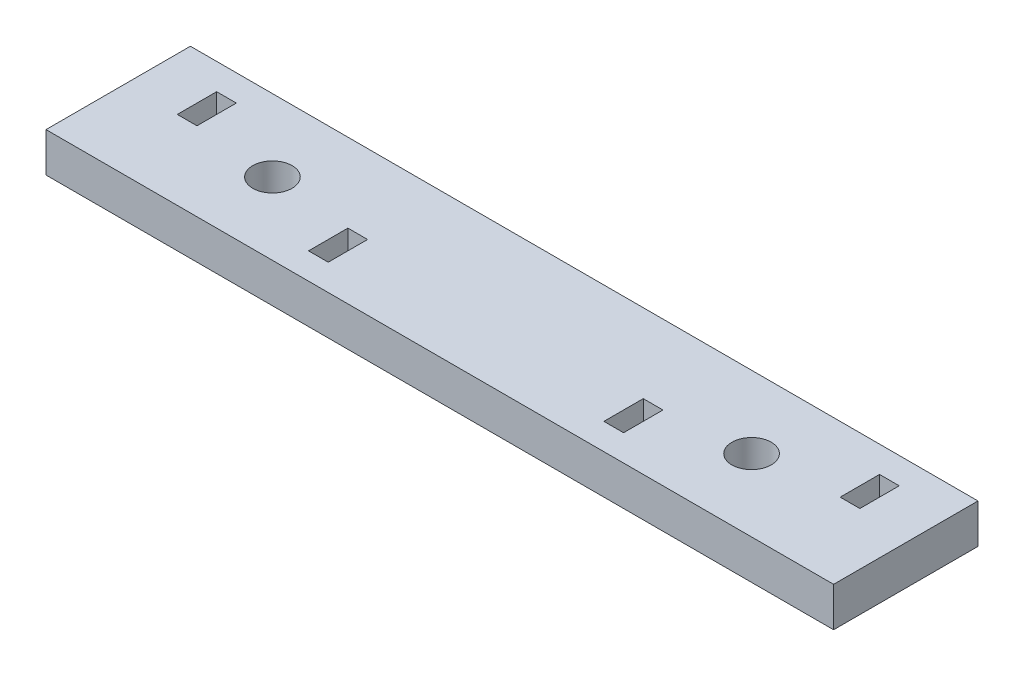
ISO-10303-21;
HEADER;
FILE_DESCRIPTION(('STEP AP214'),'2;1');
FILE_NAME('part.step','',(''),(''),'','','');
FILE_SCHEMA(('AUTOMOTIVE_DESIGN { 1 0 10303 214 1 1 1 1 }'));
ENDSEC;
DATA;
#1=APPLICATION_CONTEXT('core data for automotive mechanical design processes');
#2=APPLICATION_PROTOCOL_DEFINITION('international standard','automotive_design',2000,#1);
#3=PRODUCT_CONTEXT('',#1,'mechanical');
#4=PRODUCT('Part','Part','',(#3));
#5=PRODUCT_RELATED_PRODUCT_CATEGORY('part','',(#4));
#6=PRODUCT_DEFINITION_FORMATION('','',#4);
#7=PRODUCT_DEFINITION_CONTEXT('part definition',#1,'design');
#8=PRODUCT_DEFINITION('design','',#6,#7);
#9=PRODUCT_DEFINITION_SHAPE('','',#8);
#10=(LENGTH_UNIT() NAMED_UNIT(*) SI_UNIT(.MILLI.,.METRE.));
#11=(NAMED_UNIT(*) PLANE_ANGLE_UNIT() SI_UNIT($,.RADIAN.));
#12=(NAMED_UNIT(*) SI_UNIT($,.STERADIAN.) SOLID_ANGLE_UNIT());
#13=UNCERTAINTY_MEASURE_WITH_UNIT(LENGTH_MEASURE(1.E-05),#10,'distance_accuracy_value','');
#14=(GEOMETRIC_REPRESENTATION_CONTEXT(3) GLOBAL_UNCERTAINTY_ASSIGNED_CONTEXT((#13)) GLOBAL_UNIT_ASSIGNED_CONTEXT((#10,
#11,#12)) REPRESENTATION_CONTEXT('',''));
#15=CARTESIAN_POINT('',(0.,0.,0.));
#16=DIRECTION('',(0.,0.,1.));
#17=DIRECTION('',(1.,0.,0.));
#18=AXIS2_PLACEMENT_3D('',#15,#16,#17);
#19=CARTESIAN_POINT('',(114.3,19.05,-34.9250000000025));
#20=DIRECTION('',(-1.,0.,0.));
#21=DIRECTION('',(0.,0.,1.));
#22=AXIS2_PLACEMENT_3D('',#19,#20,#21);
#23=PLANE('',#22);
#24=DIRECTION('',(0.,0.,-1.));
#25=VECTOR('',#24,1.);
#26=CARTESIAN_POINT('',(114.3,0.,-34.9250000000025));
#27=LINE('',#26,#25);
#28=CARTESIAN_POINT('',(114.3,0.,-12.6999999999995));
#29=VERTEX_POINT('',#28);
#30=CARTESIAN_POINT('',(114.3,0.,-31.7499999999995));
#31=VERTEX_POINT('',#30);
#32=EDGE_CURVE('E257',#29,#31,#27,.T.);
#33=ORIENTED_EDGE('',*,*,#32,.T.);
#34=DIRECTION('',(0.,-1.,0.));
#35=VECTOR('',#34,1.);
#36=CARTESIAN_POINT('',(114.3,19.05,-31.7499999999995));
#37=LINE('',#36,#35);
#38=CARTESIAN_POINT('',(114.3,19.05,-31.7499999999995));
#39=VERTEX_POINT('',#38);
#40=EDGE_CURVE('E11',#39,#31,#37,.T.);
#41=ORIENTED_EDGE('',*,*,#40,.F.);
#42=DIRECTION('',(0.,0.,-1.));
#43=VECTOR('',#42,1.);
#44=CARTESIAN_POINT('',(114.3,19.05,-34.9250000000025));
#45=LINE('',#44,#43);
#46=CARTESIAN_POINT('',(114.3,19.05,-12.6999999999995));
#47=VERTEX_POINT('',#46);
#48=EDGE_CURVE('E186',#47,#39,#45,.T.);
#49=ORIENTED_EDGE('',*,*,#48,.F.);
#50=DIRECTION('',(0.,-1.,0.));
#51=VECTOR('',#50,1.);
#52=CARTESIAN_POINT('',(114.3,19.05,-12.6999999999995));
#53=LINE('',#52,#51);
#54=EDGE_CURVE('E54',#47,#29,#53,.T.);
#55=ORIENTED_EDGE('',*,*,#54,.T.);
#56=EDGE_LOOP('',(#33,#41,#49,#55));
#57=FACE_BOUND('',#56,.T.);
#58=ADVANCED_FACE('F35',(#57),#23,.F.);
#59=CARTESIAN_POINT('',(-110.929014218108,19.05,-31.749999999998));
#60=DIRECTION('',(0.,0.,-1.));
#61=DIRECTION('',(-1.,0.,0.));
#62=AXIS2_PLACEMENT_3D('',#59,#60,#61);
#63=PLANE('',#62);
#64=DIRECTION('',(1.,0.,0.));
#65=VECTOR('',#64,1.);
#66=CARTESIAN_POINT('',(-110.929014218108,0.,-31.749999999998));
#67=LINE('',#66,#65);
#68=CARTESIAN_POINT('',(123.825,0.,-31.7499999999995));
#69=VERTEX_POINT('',#68);
#70=EDGE_CURVE('E192',#31,#69,#67,.T.);
#71=ORIENTED_EDGE('',*,*,#70,.T.);
#72=DIRECTION('',(0.,-1.,0.));
#73=VECTOR('',#72,1.);
#74=CARTESIAN_POINT('',(123.825,19.05,-31.7499999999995));
#75=LINE('',#74,#73);
#76=CARTESIAN_POINT('',(123.825,19.05,-31.7499999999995));
#77=VERTEX_POINT('',#76);
#78=EDGE_CURVE('E45',#77,#69,#75,.T.);
#79=ORIENTED_EDGE('',*,*,#78,.F.);
#80=DIRECTION('',(1.,0.,0.));
#81=VECTOR('',#80,1.);
#82=CARTESIAN_POINT('',(-110.929014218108,19.05,-31.749999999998));
#83=LINE('',#82,#81);
#84=EDGE_CURVE('E180',#39,#77,#83,.T.);
#85=ORIENTED_EDGE('',*,*,#84,.F.);
#86=ORIENTED_EDGE('',*,*,#40,.T.);
#87=EDGE_LOOP('',(#71,#79,#85,#86));
#88=FACE_BOUND('',#87,.T.);
#89=ADVANCED_FACE('F191',(#88),#63,.F.);
#90=CARTESIAN_POINT('',(123.825,19.05,-34.9250000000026));
#91=DIRECTION('',(-1.,0.,0.));
#92=DIRECTION('',(0.,0.,1.));
#93=AXIS2_PLACEMENT_3D('',#90,#91,#92);
#94=PLANE('',#93);
#95=DIRECTION('',(0.,0.,-1.));
#96=VECTOR('',#95,1.);
#97=CARTESIAN_POINT('',(123.825,0.,-34.9250000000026));
#98=LINE('',#97,#96);
#99=CARTESIAN_POINT('',(123.825,0.,-12.6999999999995));
#100=VERTEX_POINT('',#99);
#101=EDGE_CURVE('E260',#100,#69,#98,.T.);
#102=ORIENTED_EDGE('',*,*,#101,.F.);
#103=DIRECTION('',(0.,-1.,0.));
#104=VECTOR('',#103,1.);
#105=CARTESIAN_POINT('',(123.825,19.05,-12.6999999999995));
#106=LINE('',#105,#104);
#107=CARTESIAN_POINT('',(123.825,19.05,-12.6999999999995));
#108=VERTEX_POINT('',#107);
#109=EDGE_CURVE('E116',#108,#100,#106,.T.);
#110=ORIENTED_EDGE('',*,*,#109,.F.);
#111=DIRECTION('',(0.,0.,-1.));
#112=VECTOR('',#111,1.);
#113=CARTESIAN_POINT('',(123.825,19.05,-34.9250000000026));
#114=LINE('',#113,#112);
#115=EDGE_CURVE('E185',#108,#77,#114,.T.);
#116=ORIENTED_EDGE('',*,*,#115,.T.);
#117=ORIENTED_EDGE('',*,*,#78,.T.);
#118=EDGE_LOOP('',(#102,#110,#116,#117));
#119=FACE_BOUND('',#118,.T.);
#120=ADVANCED_FACE('F196',(#119),#94,.T.);
#121=CARTESIAN_POINT('',(-110.929014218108,19.05,-38.0999999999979));
#122=DIRECTION('',(0.,0.,-1.));
#123=DIRECTION('',(-1.,0.,0.));
#124=AXIS2_PLACEMENT_3D('',#121,#122,#123);
#125=PLANE('',#124);
#126=DIRECTION('',(1.,0.,0.));
#127=VECTOR('',#126,1.);
#128=CARTESIAN_POINT('',(-110.929014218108,0.,-38.0999999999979));
#129=LINE('',#128,#127);
#130=CARTESIAN_POINT('',(25.4,0.,-38.0999999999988));
#131=VERTEX_POINT('',#130);
#132=CARTESIAN_POINT('',(34.925,0.,-38.0999999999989));
#133=VERTEX_POINT('',#132);
#134=EDGE_CURVE('E245',#131,#133,#129,.T.);
#135=ORIENTED_EDGE('',*,*,#134,.F.);
#136=DIRECTION('',(0.,-1.,0.));
#137=VECTOR('',#136,1.);
#138=CARTESIAN_POINT('',(25.4,19.05,-38.0999999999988));
#139=LINE('',#138,#137);
#140=CARTESIAN_POINT('',(25.4,19.05,-38.0999999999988));
#141=VERTEX_POINT('',#140);
#142=EDGE_CURVE('E267',#141,#131,#139,.T.);
#143=ORIENTED_EDGE('',*,*,#142,.F.);
#144=DIRECTION('',(1.,0.,0.));
#145=VECTOR('',#144,1.);
#146=CARTESIAN_POINT('',(-110.929014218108,19.05,-38.0999999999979));
#147=LINE('',#146,#145);
#148=CARTESIAN_POINT('',(34.925,19.05,-38.0999999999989));
#149=VERTEX_POINT('',#148);
#150=EDGE_CURVE('E577',#141,#149,#147,.T.);
#151=ORIENTED_EDGE('',*,*,#150,.T.);
#152=DIRECTION('',(0.,-1.,0.));
#153=VECTOR('',#152,1.);
#154=CARTESIAN_POINT('',(34.925,19.05,-38.0999999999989));
#155=LINE('',#154,#153);
#156=EDGE_CURVE('E269',#149,#133,#155,.T.);
#157=ORIENTED_EDGE('',*,*,#156,.T.);
#158=EDGE_LOOP('',(#135,#143,#151,#157));
#159=FACE_BOUND('',#158,.T.);
#160=ADVANCED_FACE('F348',(#159),#125,.T.);
#161=CARTESIAN_POINT('',(25.4,19.05,-34.9250000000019));
#162=DIRECTION('',(1.,0.,0.));
#163=DIRECTION('',(0.,0.,-1.));
#164=AXIS2_PLACEMENT_3D('',#161,#162,#163);
#165=PLANE('',#164);
#166=DIRECTION('',(0.,0.,1.));
#167=VECTOR('',#166,1.);
#168=CARTESIAN_POINT('',(25.4,0.,-34.9250000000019));
#169=LINE('',#168,#167);
#170=CARTESIAN_POINT('',(25.3999999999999,0.,-57.1499999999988));
#171=VERTEX_POINT('',#170);
#172=EDGE_CURVE('E248',#171,#131,#169,.T.);
#173=ORIENTED_EDGE('',*,*,#172,.F.);
#174=DIRECTION('',(0.,-1.,0.));
#175=VECTOR('',#174,1.);
#176=CARTESIAN_POINT('',(25.3999999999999,19.05,-57.1499999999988));
#177=LINE('',#176,#175);
#178=CARTESIAN_POINT('',(25.3999999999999,19.05,-57.1499999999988));
#179=VERTEX_POINT('',#178);
#180=EDGE_CURVE('E275',#179,#171,#177,.T.);
#181=ORIENTED_EDGE('',*,*,#180,.F.);
#182=DIRECTION('',(0.,0.,1.));
#183=VECTOR('',#182,1.);
#184=CARTESIAN_POINT('',(25.4,19.05,-34.9250000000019));
#185=LINE('',#184,#183);
#186=EDGE_CURVE('E580',#179,#141,#185,.T.);
#187=ORIENTED_EDGE('',*,*,#186,.T.);
#188=ORIENTED_EDGE('',*,*,#142,.T.);
#189=EDGE_LOOP('',(#173,#181,#187,#188));
#190=FACE_BOUND('',#189,.T.);
#191=ADVANCED_FACE('F344',(#190),#165,.T.);
#192=CARTESIAN_POINT('',(-110.929014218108,19.05,-57.149999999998));
#193=DIRECTION('',(0.,0.,-1.));
#194=DIRECTION('',(-1.,0.,0.));
#195=AXIS2_PLACEMENT_3D('',#192,#193,#194);
#196=PLANE('',#195);
#197=DIRECTION('',(1.,0.,0.));
#198=VECTOR('',#197,1.);
#199=CARTESIAN_POINT('',(-110.929014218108,0.,-57.149999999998));
#200=LINE('',#199,#198);
#201=CARTESIAN_POINT('',(34.9249999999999,0.,-57.1499999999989));
#202=VERTEX_POINT('',#201);
#203=EDGE_CURVE('E251',#171,#202,#200,.T.);
#204=ORIENTED_EDGE('',*,*,#203,.T.);
#205=DIRECTION('',(0.,-1.,0.));
#206=VECTOR('',#205,1.);
#207=CARTESIAN_POINT('',(34.9249999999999,19.05,-57.1499999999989));
#208=LINE('',#207,#206);
#209=CARTESIAN_POINT('',(34.9249999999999,19.05,-57.1499999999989));
#210=VERTEX_POINT('',#209);
#211=EDGE_CURVE('E271',#210,#202,#208,.T.);
#212=ORIENTED_EDGE('',*,*,#211,.F.);
#213=DIRECTION('',(1.,0.,0.));
#214=VECTOR('',#213,1.);
#215=CARTESIAN_POINT('',(-110.929014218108,19.05,-57.149999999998));
#216=LINE('',#215,#214);
#217=EDGE_CURVE('E587',#179,#210,#216,.T.);
#218=ORIENTED_EDGE('',*,*,#217,.F.);
#219=ORIENTED_EDGE('',*,*,#180,.T.);
#220=EDGE_LOOP('',(#204,#212,#218,#219));
#221=FACE_BOUND('',#220,.T.);
#222=ADVANCED_FACE('F340',(#221),#196,.F.);
#223=CARTESIAN_POINT('',(-110.929014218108,19.05,-4.5102810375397E-13));
#224=DIRECTION('',(0.,0.,1.));
#225=DIRECTION('',(1.,0.,0.));
#226=AXIS2_PLACEMENT_3D('',#223,#224,#225);
#227=PLANE('',#226);
#228=DIRECTION('',(-1.,0.,0.));
#229=VECTOR('',#228,1.);
#230=CARTESIAN_POINT('',(-110.929014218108,0.,-4.5102810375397E-13));
#231=LINE('',#230,#229);
#232=CARTESIAN_POINT('',(381.,0.,-1.33226762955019E-12));
#233=VERTEX_POINT('',#232);
#234=CARTESIAN_POINT('',(2.77555756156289E-13,0.,-6.50068807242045E-13));
#235=VERTEX_POINT('',#234);
#236=EDGE_CURVE('E230',#233,#235,#231,.T.);
#237=ORIENTED_EDGE('',*,*,#236,.F.);
#238=DIRECTION('',(0.,-1.,0.));
#239=VECTOR('',#238,1.);
#240=CARTESIAN_POINT('',(381.,19.05,-1.33226762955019E-12));
#241=LINE('',#240,#239);
#242=CARTESIAN_POINT('',(381.,19.05,-1.33226762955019E-12));
#243=VERTEX_POINT('',#242);
#244=EDGE_CURVE('E272',#243,#233,#241,.T.);
#245=ORIENTED_EDGE('',*,*,#244,.F.);
#246=DIRECTION('',(-1.,0.,0.));
#247=VECTOR('',#246,1.);
#248=CARTESIAN_POINT('',(-110.929014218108,19.05,-4.5102810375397E-13));
#249=LINE('',#248,#247);
#250=CARTESIAN_POINT('',(2.77555756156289E-13,19.05,-6.50068807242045E-13));
#251=VERTEX_POINT('',#250);
#252=EDGE_CURVE('E568',#243,#251,#249,.T.);
#253=ORIENTED_EDGE('',*,*,#252,.T.);
#254=DIRECTION('',(0.,-1.,0.));
#255=VECTOR('',#254,1.);
#256=CARTESIAN_POINT('',(2.77555756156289E-13,19.05,-6.50068807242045E-13));
#257=LINE('',#256,#255);
#258=EDGE_CURVE('E278',#251,#235,#257,.T.);
#259=ORIENTED_EDGE('',*,*,#258,.T.);
#260=EDGE_LOOP('',(#237,#245,#253,#259));
#261=FACE_BOUND('',#260,.T.);
#262=ADVANCED_FACE('F343',(#261),#227,.T.);
#263=CARTESIAN_POINT('',(381.000000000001,19.05,-34.9250000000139));
#264=DIRECTION('',(1.,0.,0.));
#265=DIRECTION('',(0.,0.,-1.));
#266=AXIS2_PLACEMENT_3D('',#263,#264,#265);
#267=PLANE('',#266);
#268=DIRECTION('',(0.,0.,1.));
#269=VECTOR('',#268,1.);
#270=CARTESIAN_POINT('',(381.000000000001,0.,-34.9250000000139));
#271=LINE('',#270,#269);
#272=CARTESIAN_POINT('',(381.,0.,-69.8500000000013));
#273=VERTEX_POINT('',#272);
#274=EDGE_CURVE('E233',#273,#233,#271,.T.);
#275=ORIENTED_EDGE('',*,*,#274,.F.);
#276=DIRECTION('',(0.,-1.,0.));
#277=VECTOR('',#276,1.);
#278=CARTESIAN_POINT('',(381.,19.05,-69.8500000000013));
#279=LINE('',#278,#277);
#280=CARTESIAN_POINT('',(381.,19.05,-69.8500000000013));
#281=VERTEX_POINT('',#280);
#282=EDGE_CURVE('E284',#281,#273,#279,.T.);
#283=ORIENTED_EDGE('',*,*,#282,.F.);
#284=DIRECTION('',(0.,0.,1.));
#285=VECTOR('',#284,1.);
#286=CARTESIAN_POINT('',(381.000000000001,19.05,-34.9250000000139));
#287=LINE('',#286,#285);
#288=EDGE_CURVE('E598',#281,#243,#287,.T.);
#289=ORIENTED_EDGE('',*,*,#288,.T.);
#290=ORIENTED_EDGE('',*,*,#244,.T.);
#291=EDGE_LOOP('',(#275,#283,#289,#290));
#292=FACE_BOUND('',#291,.T.);
#293=ADVANCED_FACE('F365',(#292),#267,.T.);
#294=CARTESIAN_POINT('',(-110.929014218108,19.05,-69.8500000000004));
#295=DIRECTION('',(0.,0.,1.));
#296=DIRECTION('',(1.,0.,0.));
#297=AXIS2_PLACEMENT_3D('',#294,#295,#296);
#298=PLANE('',#297);
#299=DIRECTION('',(-1.,0.,0.));
#300=VECTOR('',#299,1.);
#301=CARTESIAN_POINT('',(-110.929014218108,0.,-69.8500000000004));
#302=LINE('',#301,#300);
#303=CARTESIAN_POINT('',(0.,0.,-69.8500000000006));
#304=VERTEX_POINT('',#303);
#305=EDGE_CURVE('E236',#273,#304,#302,.T.);
#306=ORIENTED_EDGE('',*,*,#305,.T.);
#307=DIRECTION('',(0.,-1.,0.));
#308=VECTOR('',#307,1.);
#309=CARTESIAN_POINT('',(0.,19.05,-69.8500000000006));
#310=LINE('',#309,#308);
#311=CARTESIAN_POINT('',(0.,19.05,-69.8500000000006));
#312=VERTEX_POINT('',#311);
#313=EDGE_CURVE('E280',#312,#304,#310,.T.);
#314=ORIENTED_EDGE('',*,*,#313,.F.);
#315=DIRECTION('',(-1.,0.,0.));
#316=VECTOR('',#315,1.);
#317=CARTESIAN_POINT('',(-110.929014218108,19.05,-69.8500000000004));
#318=LINE('',#317,#316);
#319=EDGE_CURVE('E595',#281,#312,#318,.T.);
#320=ORIENTED_EDGE('',*,*,#319,.F.);
#321=ORIENTED_EDGE('',*,*,#282,.T.);
#322=EDGE_LOOP('',(#306,#314,#320,#321));
#323=FACE_BOUND('',#322,.T.);
#324=ADVANCED_FACE('F361',(#323),#298,.F.);
#325=CARTESIAN_POINT('',(266.7,19.05,-34.9250000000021));
#326=DIRECTION('',(-1.,0.,0.));
#327=DIRECTION('',(0.,0.,1.));
#328=AXIS2_PLACEMENT_3D('',#325,#326,#327);
#329=PLANE('',#328);
#330=DIRECTION('',(0.,0.,-1.));
#331=VECTOR('',#330,1.);
#332=CARTESIAN_POINT('',(266.7,0.,-34.9250000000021));
#333=LINE('',#332,#331);
#334=CARTESIAN_POINT('',(266.7,0.,-12.7000000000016));
#335=VERTEX_POINT('',#334);
#336=CARTESIAN_POINT('',(266.7,0.,-31.7500000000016));
#337=VERTEX_POINT('',#336);
#338=EDGE_CURVE('E218',#335,#337,#333,.T.);
#339=ORIENTED_EDGE('',*,*,#338,.F.);
#340=DIRECTION('',(0.,-1.,0.));
#341=VECTOR('',#340,1.);
#342=CARTESIAN_POINT('',(266.7,19.05,-12.7000000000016));
#343=LINE('',#342,#341);
#344=CARTESIAN_POINT('',(266.7,19.05,-12.7000000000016));
#345=VERTEX_POINT('',#344);
#346=EDGE_CURVE('E281',#345,#335,#343,.T.);
#347=ORIENTED_EDGE('',*,*,#346,.F.);
#348=DIRECTION('',(0.,0.,-1.));
#349=VECTOR('',#348,1.);
#350=CARTESIAN_POINT('',(266.7,19.05,-34.9250000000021));
#351=LINE('',#350,#349);
#352=CARTESIAN_POINT('',(266.7,19.05,-31.7500000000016));
#353=VERTEX_POINT('',#352);
#354=EDGE_CURVE('E563',#345,#353,#351,.T.);
#355=ORIENTED_EDGE('',*,*,#354,.T.);
#356=DIRECTION('',(0.,-1.,0.));
#357=VECTOR('',#356,1.);
#358=CARTESIAN_POINT('',(266.7,19.05,-31.7500000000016));
#359=LINE('',#358,#357);
#360=EDGE_CURVE('E287',#353,#337,#359,.T.);
#361=ORIENTED_EDGE('',*,*,#360,.T.);
#362=EDGE_LOOP('',(#339,#347,#355,#361));
#363=FACE_BOUND('',#362,.T.);
#364=ADVANCED_FACE('F364',(#363),#329,.T.);
#365=CARTESIAN_POINT('',(-110.929014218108,19.05,-12.7000000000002));
#366=DIRECTION('',(0.,0.,1.));
#367=DIRECTION('',(1.,0.,0.));
#368=AXIS2_PLACEMENT_3D('',#365,#366,#367);
#369=PLANE('',#368);
#370=DIRECTION('',(-1.,0.,0.));
#371=VECTOR('',#370,1.);
#372=CARTESIAN_POINT('',(-110.929014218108,0.,-12.7000000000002));
#373=LINE('',#372,#371);
#374=CARTESIAN_POINT('',(257.175,0.,-12.7000000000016));
#375=VERTEX_POINT('',#374);
#376=EDGE_CURVE('E221',#335,#375,#373,.T.);
#377=ORIENTED_EDGE('',*,*,#376,.T.);
#378=DIRECTION('',(0.,-1.,0.));
#379=VECTOR('',#378,1.);
#380=CARTESIAN_POINT('',(257.175,19.05,-12.7000000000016));
#381=LINE('',#380,#379);
#382=CARTESIAN_POINT('',(257.175,19.05,-12.7000000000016));
#383=VERTEX_POINT('',#382);
#384=EDGE_CURVE('E291',#383,#375,#381,.T.);
#385=ORIENTED_EDGE('',*,*,#384,.F.);
#386=DIRECTION('',(-1.,0.,0.));
#387=VECTOR('',#386,1.);
#388=CARTESIAN_POINT('',(-110.929014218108,19.05,-12.7000000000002));
#389=LINE('',#388,#387);
#390=EDGE_CURVE('E606',#345,#383,#389,.T.);
#391=ORIENTED_EDGE('',*,*,#390,.F.);
#392=ORIENTED_EDGE('',*,*,#346,.T.);
#393=EDGE_LOOP('',(#377,#385,#391,#392));
#394=FACE_BOUND('',#393,.T.);
#395=ADVANCED_FACE('F379',(#394),#369,.F.);
#396=CARTESIAN_POINT('',(257.175,19.05,-34.9250000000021));
#397=DIRECTION('',(-1.,0.,0.));
#398=DIRECTION('',(0.,0.,1.));
#399=AXIS2_PLACEMENT_3D('',#396,#397,#398);
#400=PLANE('',#399);
#401=DIRECTION('',(0.,0.,-1.));
#402=VECTOR('',#401,1.);
#403=CARTESIAN_POINT('',(257.175,0.,-34.9250000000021));
#404=LINE('',#403,#402);
#405=CARTESIAN_POINT('',(257.175,0.,-31.7500000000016));
#406=VERTEX_POINT('',#405);
#407=EDGE_CURVE('E224',#375,#406,#404,.T.);
#408=ORIENTED_EDGE('',*,*,#407,.T.);
#409=DIRECTION('',(0.,-1.,0.));
#410=VECTOR('',#409,1.);
#411=CARTESIAN_POINT('',(257.175,19.05,-31.7500000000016));
#412=LINE('',#411,#410);
#413=CARTESIAN_POINT('',(257.175,19.05,-31.7500000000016));
#414=VERTEX_POINT('',#413);
#415=EDGE_CURVE('E289',#414,#406,#412,.T.);
#416=ORIENTED_EDGE('',*,*,#415,.F.);
#417=DIRECTION('',(0.,0.,-1.));
#418=VECTOR('',#417,1.);
#419=CARTESIAN_POINT('',(257.175,19.05,-34.9250000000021));
#420=LINE('',#419,#418);
#421=EDGE_CURVE('E604',#383,#414,#420,.T.);
#422=ORIENTED_EDGE('',*,*,#421,.F.);
#423=ORIENTED_EDGE('',*,*,#384,.T.);
#424=EDGE_LOOP('',(#408,#416,#422,#423));
#425=FACE_BOUND('',#424,.T.);
#426=ADVANCED_FACE('F376',(#425),#400,.F.);
#427=CARTESIAN_POINT('',(-110.929014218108,19.05,-57.1500000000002));
#428=DIRECTION('',(0.,0.,1.));
#429=DIRECTION('',(1.,0.,0.));
#430=AXIS2_PLACEMENT_3D('',#427,#428,#429);
#431=PLANE('',#430);
#432=DIRECTION('',(-1.,0.,0.));
#433=VECTOR('',#432,1.);
#434=CARTESIAN_POINT('',(-110.929014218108,0.,-57.1500000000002));
#435=LINE('',#434,#433);
#436=CARTESIAN_POINT('',(355.6,0.,-57.1500000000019));
#437=VERTEX_POINT('',#436);
#438=CARTESIAN_POINT('',(346.075,0.,-57.1500000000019));
#439=VERTEX_POINT('',#438);
#440=EDGE_CURVE('E206',#437,#439,#435,.T.);
#441=ORIENTED_EDGE('',*,*,#440,.F.);
#442=DIRECTION('',(0.,-1.,0.));
#443=VECTOR('',#442,1.);
#444=CARTESIAN_POINT('',(355.6,19.05,-57.1500000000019));
#445=LINE('',#444,#443);
#446=CARTESIAN_POINT('',(355.6,19.05,-57.1500000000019));
#447=VERTEX_POINT('',#446);
#448=EDGE_CURVE('E39',#447,#437,#445,.T.);
#449=ORIENTED_EDGE('',*,*,#448,.F.);
#450=DIRECTION('',(-1.,0.,0.));
#451=VECTOR('',#450,1.);
#452=CARTESIAN_POINT('',(-110.929014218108,19.05,-57.1500000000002));
#453=LINE('',#452,#451);
#454=CARTESIAN_POINT('',(346.075,19.05,-57.1500000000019));
#455=VERTEX_POINT('',#454);
#456=EDGE_CURVE('E312',#447,#455,#453,.T.);
#457=ORIENTED_EDGE('',*,*,#456,.T.);
#458=DIRECTION('',(0.,-1.,0.));
#459=VECTOR('',#458,1.);
#460=CARTESIAN_POINT('',(346.075,19.05,-57.1500000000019));
#461=LINE('',#460,#459);
#462=EDGE_CURVE('E199',#455,#439,#461,.T.);
#463=ORIENTED_EDGE('',*,*,#462,.T.);
#464=EDGE_LOOP('',(#441,#449,#457,#463));
#465=FACE_BOUND('',#464,.T.);
#466=ADVANCED_FACE('F311',(#465),#431,.T.);
#467=CARTESIAN_POINT('',(355.6,19.05,-34.9250000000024));
#468=DIRECTION('',(1.,0.,0.));
#469=DIRECTION('',(0.,0.,-1.));
#470=AXIS2_PLACEMENT_3D('',#467,#468,#469);
#471=PLANE('',#470);
#472=DIRECTION('',(0.,0.,1.));
#473=VECTOR('',#472,1.);
#474=CARTESIAN_POINT('',(355.6,0.,-34.9250000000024));
#475=LINE('',#474,#473);
#476=CARTESIAN_POINT('',(355.6,0.,-38.1000000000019));
#477=VERTEX_POINT('',#476);
#478=EDGE_CURVE('E209',#437,#477,#475,.T.);
#479=ORIENTED_EDGE('',*,*,#478,.T.);
#480=DIRECTION('',(0.,-1.,0.));
#481=VECTOR('',#480,1.);
#482=CARTESIAN_POINT('',(355.6,19.05,-38.1000000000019));
#483=LINE('',#482,#481);
#484=CARTESIAN_POINT('',(355.6,19.05,-38.1000000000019));
#485=VERTEX_POINT('',#484);
#486=EDGE_CURVE('E297',#485,#477,#483,.T.);
#487=ORIENTED_EDGE('',*,*,#486,.F.);
#488=DIRECTION('',(0.,0.,1.));
#489=VECTOR('',#488,1.);
#490=CARTESIAN_POINT('',(355.6,19.05,-34.9250000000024));
#491=LINE('',#490,#489);
#492=EDGE_CURVE('E305',#447,#485,#491,.T.);
#493=ORIENTED_EDGE('',*,*,#492,.F.);
#494=ORIENTED_EDGE('',*,*,#448,.T.);
#495=EDGE_LOOP('',(#479,#487,#493,#494));
#496=FACE_BOUND('',#495,.T.);
#497=ADVANCED_FACE('F303',(#496),#471,.F.);
#498=CARTESIAN_POINT('',(-110.929014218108,19.05,-38.1000000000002));
#499=DIRECTION('',(0.,0.,1.));
#500=DIRECTION('',(1.,0.,0.));
#501=AXIS2_PLACEMENT_3D('',#498,#499,#500);
#502=PLANE('',#501);
#503=DIRECTION('',(-1.,0.,0.));
#504=VECTOR('',#503,1.);
#505=CARTESIAN_POINT('',(-110.929014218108,0.,-38.1000000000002));
#506=LINE('',#505,#504);
#507=CARTESIAN_POINT('',(346.075,0.,-38.1000000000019));
#508=VERTEX_POINT('',#507);
#509=EDGE_CURVE('E212',#477,#508,#506,.T.);
#510=ORIENTED_EDGE('',*,*,#509,.T.);
#511=DIRECTION('',(0.,-1.,0.));
#512=VECTOR('',#511,1.);
#513=CARTESIAN_POINT('',(346.075,19.05,-38.1000000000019));
#514=LINE('',#513,#512);
#515=CARTESIAN_POINT('',(346.075,19.05,-38.1000000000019));
#516=VERTEX_POINT('',#515);
#517=EDGE_CURVE('E296',#516,#508,#514,.T.);
#518=ORIENTED_EDGE('',*,*,#517,.F.);
#519=DIRECTION('',(-1.,0.,0.));
#520=VECTOR('',#519,1.);
#521=CARTESIAN_POINT('',(-110.929014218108,19.05,-38.1000000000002));
#522=LINE('',#521,#520);
#523=EDGE_CURVE('E610',#485,#516,#522,.T.);
#524=ORIENTED_EDGE('',*,*,#523,.F.);
#525=ORIENTED_EDGE('',*,*,#486,.T.);
#526=EDGE_LOOP('',(#510,#518,#524,#525));
#527=FACE_BOUND('',#526,.T.);
#528=ADVANCED_FACE('F319',(#527),#502,.F.);
#529=CARTESIAN_POINT('',(34.925,19.05,-34.9250000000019));
#530=DIRECTION('',(1.,0.,0.));
#531=DIRECTION('',(0.,0.,-1.));
#532=AXIS2_PLACEMENT_3D('',#529,#530,#531);
#533=PLANE('',#532);
#534=DIRECTION('',(0.,0.,1.));
#535=VECTOR('',#534,1.);
#536=CARTESIAN_POINT('',(34.925,0.,-34.9250000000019));
#537=LINE('',#536,#535);
#538=EDGE_CURVE('E254',#202,#133,#537,.T.);
#539=ORIENTED_EDGE('',*,*,#538,.T.);
#540=ORIENTED_EDGE('',*,*,#156,.F.);
#541=DIRECTION('',(0.,0.,1.));
#542=VECTOR('',#541,1.);
#543=CARTESIAN_POINT('',(34.925,19.05,-34.9250000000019));
#544=LINE('',#543,#542);
#545=EDGE_CURVE('E581',#210,#149,#544,.T.);
#546=ORIENTED_EDGE('',*,*,#545,.F.);
#547=ORIENTED_EDGE('',*,*,#211,.T.);
#548=EDGE_LOOP('',(#539,#540,#546,#547));
#549=FACE_BOUND('',#548,.T.);
#550=ADVANCED_FACE('F321',(#549),#533,.F.);
#551=CARTESIAN_POINT('',(74.6125,19.05,-34.9249999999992));
#552=DIRECTION('',(0.,-1.,0.));
#553=DIRECTION('',(0.,0.,-1.));
#554=AXIS2_PLACEMENT_3D('',#551,#552,#553);
#555=CYLINDRICAL_SURFACE('',#554,9.52500000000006);
#556=CARTESIAN_POINT('',(74.6125,19.05,-34.9249999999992));
#557=DIRECTION('',(0.,1.,0.));
#558=DIRECTION('',(0.,0.,1.));
#559=AXIS2_PLACEMENT_3D('',#556,#557,#558);
#560=CIRCLE('',#559,9.52500000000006);
#561=CARTESIAN_POINT('',(74.6125,19.05,-44.4499999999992));
#562=VERTEX_POINT('',#561);
#563=EDGE_CURVE('E573',#562,#562,#560,.F.);
#564=CARTESIAN_POINT('',(74.6125,0.,-34.9249999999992));
#565=DIRECTION('',(0.,1.,0.));
#566=DIRECTION('',(0.,0.,1.));
#567=AXIS2_PLACEMENT_3D('',#564,#565,#566);
#568=CIRCLE('',#567,9.52500000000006);
#569=CARTESIAN_POINT('',(74.6125,0.,-44.4499999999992));
#570=VERTEX_POINT('',#569);
#571=EDGE_CURVE('E242',#570,#570,#568,.F.);
#572=CARTESIAN_POINT('',(74.6125,19.05,-44.4499999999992));
#573=CARTESIAN_POINT('',(74.6125,18.8515625,-44.4499999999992));
#574=CARTESIAN_POINT('',(74.6125,18.653125,-44.4499999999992));
#575=CARTESIAN_POINT('',(74.6125,18.25625,-44.4499999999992));
#576=CARTESIAN_POINT('',(74.6125,18.0578125,-44.4499999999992));
#577=CARTESIAN_POINT('',(74.6125,17.6609375,-44.4499999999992));
#578=CARTESIAN_POINT('',(74.6125,17.4625,-44.4499999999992));
#579=CARTESIAN_POINT('',(74.6125,17.065625,-44.4499999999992));
#580=CARTESIAN_POINT('',(74.6125,16.8671875,-44.4499999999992));
#581=CARTESIAN_POINT('',(74.6125,16.4703125,-44.4499999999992));
#582=CARTESIAN_POINT('',(74.6125,16.271875,-44.4499999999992));
#583=CARTESIAN_POINT('',(74.6125,15.875,-44.4499999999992));
#584=CARTESIAN_POINT('',(74.6125,15.6765625,-44.4499999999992));
#585=CARTESIAN_POINT('',(74.6125,15.2796875,-44.4499999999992));
#586=CARTESIAN_POINT('',(74.6125,15.08125,-44.4499999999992));
#587=CARTESIAN_POINT('',(74.6125,14.684375,-44.4499999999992));
#588=CARTESIAN_POINT('',(74.6125,14.4859375,-44.4499999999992));
#589=CARTESIAN_POINT('',(74.6125,14.0890625,-44.4499999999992));
#590=CARTESIAN_POINT('',(74.6125,13.890625,-44.4499999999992));
#591=CARTESIAN_POINT('',(74.6125,13.49375,-44.4499999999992));
#592=CARTESIAN_POINT('',(74.6125,13.2953125,-44.4499999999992));
#593=CARTESIAN_POINT('',(74.6125,12.8984375,-44.4499999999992));
#594=CARTESIAN_POINT('',(74.6125,12.7,-44.4499999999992));
#595=CARTESIAN_POINT('',(74.6125,12.303125,-44.4499999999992));
#596=CARTESIAN_POINT('',(74.6125,12.1046875,-44.4499999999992));
#597=CARTESIAN_POINT('',(74.6125,11.7078125,-44.4499999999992));
#598=CARTESIAN_POINT('',(74.6125,11.509375,-44.4499999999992));
#599=CARTESIAN_POINT('',(74.6125,11.1125,-44.4499999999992));
#600=CARTESIAN_POINT('',(74.6125,10.9140625,-44.4499999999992));
#601=CARTESIAN_POINT('',(74.6125,10.5171875,-44.4499999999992));
#602=CARTESIAN_POINT('',(74.6125,10.31875,-44.4499999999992));
#603=CARTESIAN_POINT('',(74.6125,9.921875,-44.4499999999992));
#604=CARTESIAN_POINT('',(74.6125,9.7234375,-44.4499999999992));
#605=CARTESIAN_POINT('',(74.6125,9.3265625,-44.4499999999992));
#606=CARTESIAN_POINT('',(74.6125,9.128125,-44.4499999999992));
#607=CARTESIAN_POINT('',(74.6125,8.73125,-44.4499999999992));
#608=CARTESIAN_POINT('',(74.6125,8.5328125,-44.4499999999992));
#609=CARTESIAN_POINT('',(74.6125,8.1359375,-44.4499999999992));
#610=CARTESIAN_POINT('',(74.6125,7.9375,-44.4499999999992));
#611=CARTESIAN_POINT('',(74.6125,7.540625,-44.4499999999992));
#612=CARTESIAN_POINT('',(74.6125,7.3421875,-44.4499999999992));
#613=CARTESIAN_POINT('',(74.6125,6.9453125,-44.4499999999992));
#614=CARTESIAN_POINT('',(74.6125,6.746875,-44.4499999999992));
#615=CARTESIAN_POINT('',(74.6125,6.35,-44.4499999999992));
#616=CARTESIAN_POINT('',(74.6125,6.1515625,-44.4499999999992));
#617=CARTESIAN_POINT('',(74.6125,5.7546875,-44.4499999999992));
#618=CARTESIAN_POINT('',(74.6125,5.55625,-44.4499999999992));
#619=CARTESIAN_POINT('',(74.6125,5.159375,-44.4499999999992));
#620=CARTESIAN_POINT('',(74.6125,4.9609375,-44.4499999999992));
#621=CARTESIAN_POINT('',(74.6125,4.5640625,-44.4499999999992));
#622=CARTESIAN_POINT('',(74.6125,4.365625,-44.4499999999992));
#623=CARTESIAN_POINT('',(74.6125,3.96875,-44.4499999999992));
#624=CARTESIAN_POINT('',(74.6125,3.7703125,-44.4499999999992));
#625=CARTESIAN_POINT('',(74.6125,3.3734375,-44.4499999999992));
#626=CARTESIAN_POINT('',(74.6125,3.175,-44.4499999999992));
#627=CARTESIAN_POINT('',(74.6125,2.778125,-44.4499999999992));
#628=CARTESIAN_POINT('',(74.6125,2.5796875,-44.4499999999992));
#629=CARTESIAN_POINT('',(74.6125,2.1828125,-44.4499999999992));
#630=CARTESIAN_POINT('',(74.6125,1.984375,-44.4499999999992));
#631=CARTESIAN_POINT('',(74.6125,1.5875,-44.4499999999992));
#632=CARTESIAN_POINT('',(74.6125,1.3890625,-44.4499999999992));
#633=CARTESIAN_POINT('',(74.6125,0.992187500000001,-44.4499999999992));
#634=CARTESIAN_POINT('',(74.6125,0.793750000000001,-44.4499999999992));
#635=CARTESIAN_POINT('',(74.6125,0.396875,-44.4499999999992));
#636=CARTESIAN_POINT('',(74.6125,0.1984375,-44.4499999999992));
#637=CARTESIAN_POINT('',(74.6125,0.,-44.4499999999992));
#638=B_SPLINE_CURVE_WITH_KNOTS('',3,(#572,#573,#574,#575,#576,#577,#578,#579,#580,#581,#582,
#583,#584,#585,#586,#587,#588,#589,#590,#591,#592,#593,#594,#595,#596,#597,#598,#599,#600,#601,
#602,#603,#604,#605,#606,#607,#608,#609,#610,#611,#612,#613,#614,#615,#616,#617,#618,#619,#620,
#621,#622,#623,#624,#625,#626,#627,#628,#629,#630,#631,#632,#633,#634,#635,#636,#637),
.UNSPECIFIED.,.F.,.F.,(4,2,2,2,2,2,2,2,2,2,2,2,2,2,2,2,2,2,2,2,2,2,2,2,2,2,2,2,2,2,2,2,4),(0.,
0.5953125,1.190625,1.7859375,2.38125,2.9765625,3.571875,4.1671875,4.7625,5.3578125,5.953125,
6.5484375,7.14375,7.7390625,8.334375,8.9296875,9.525,10.1203125,10.715625,11.3109375,11.90625,
12.5015625,13.096875,13.6921875,14.2875,14.8828125,15.478125,16.0734375,16.66875,17.2640625,
17.859375,18.4546875,19.05),.UNSPECIFIED.);
#639=EDGE_CURVE('BSEAM327',#562,#570,#638,.T.);
#640=ORIENTED_EDGE('',*,*,#563,.F.);
#641=ORIENTED_EDGE('',*,*,#571,.T.);
#642=ORIENTED_EDGE('',*,*,#639,.T.);
#643=ORIENTED_EDGE('',*,*,#639,.F.);
#644=EDGE_LOOP('',(#640,#642,#641,#643));
#645=FACE_BOUND('',#644,.T.);
#646=ADVANCED_FACE('F327',(#645),#555,.F.);
#647=CARTESIAN_POINT('',(1.52655665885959E-13,19.05,-34.9250000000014));
#648=DIRECTION('',(1.,0.,0.));
#649=DIRECTION('',(0.,0.,-1.));
#650=AXIS2_PLACEMENT_3D('',#647,#648,#649);
#651=PLANE('',#650);
#652=DIRECTION('',(0.,0.,1.));
#653=VECTOR('',#652,1.);
#654=CARTESIAN_POINT('',(1.52655665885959E-13,0.,-34.9250000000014));
#655=LINE('',#654,#653);
#656=EDGE_CURVE('E239',#304,#235,#655,.T.);
#657=ORIENTED_EDGE('',*,*,#656,.T.);
#658=ORIENTED_EDGE('',*,*,#258,.F.);
#659=DIRECTION('',(0.,0.,1.));
#660=VECTOR('',#659,1.);
#661=CARTESIAN_POINT('',(1.52655665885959E-13,19.05,-34.9250000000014));
#662=LINE('',#661,#660);
#663=EDGE_CURVE('E593',#312,#251,#662,.T.);
#664=ORIENTED_EDGE('',*,*,#663,.F.);
#665=ORIENTED_EDGE('',*,*,#313,.T.);
#666=EDGE_LOOP('',(#657,#658,#664,#665));
#667=FACE_BOUND('',#666,.T.);
#668=ADVANCED_FACE('F355',(#667),#651,.F.);
#669=CARTESIAN_POINT('',(-110.929014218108,19.05,-31.75));
#670=DIRECTION('',(0.,0.,1.));
#671=DIRECTION('',(1.,0.,0.));
#672=AXIS2_PLACEMENT_3D('',#669,#670,#671);
#673=PLANE('',#672);
#674=DIRECTION('',(-1.,0.,0.));
#675=VECTOR('',#674,1.);
#676=CARTESIAN_POINT('',(-110.929014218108,0.,-31.75));
#677=LINE('',#676,#675);
#678=EDGE_CURVE('E227',#337,#406,#677,.T.);
#679=ORIENTED_EDGE('',*,*,#678,.F.);
#680=ORIENTED_EDGE('',*,*,#360,.F.);
#681=DIRECTION('',(-1.,0.,0.));
#682=VECTOR('',#681,1.);
#683=CARTESIAN_POINT('',(-110.929014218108,19.05,-31.75));
#684=LINE('',#683,#682);
#685=EDGE_CURVE('E601',#353,#414,#684,.T.);
#686=ORIENTED_EDGE('',*,*,#685,.T.);
#687=ORIENTED_EDGE('',*,*,#415,.T.);
#688=EDGE_LOOP('',(#679,#680,#686,#687));
#689=FACE_BOUND('',#688,.T.);
#690=ADVANCED_FACE('F359',(#689),#673,.T.);
#691=CARTESIAN_POINT('',(346.075,19.05,-34.9250000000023));
#692=DIRECTION('',(1.,0.,0.));
#693=DIRECTION('',(0.,0.,-1.));
#694=AXIS2_PLACEMENT_3D('',#691,#692,#693);
#695=PLANE('',#694);
#696=DIRECTION('',(0.,0.,1.));
#697=VECTOR('',#696,1.);
#698=CARTESIAN_POINT('',(346.075,0.,-34.9250000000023));
#699=LINE('',#698,#697);
#700=EDGE_CURVE('E215',#439,#508,#699,.T.);
#701=ORIENTED_EDGE('',*,*,#700,.F.);
#702=ORIENTED_EDGE('',*,*,#462,.F.);
#703=DIRECTION('',(0.,0.,1.));
#704=VECTOR('',#703,1.);
#705=CARTESIAN_POINT('',(346.075,19.05,-34.9250000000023));
#706=LINE('',#705,#704);
#707=EDGE_CURVE('E317',#455,#516,#706,.T.);
#708=ORIENTED_EDGE('',*,*,#707,.T.);
#709=ORIENTED_EDGE('',*,*,#517,.T.);
#710=EDGE_LOOP('',(#701,#702,#708,#709));
#711=FACE_BOUND('',#710,.T.);
#712=ADVANCED_FACE('F316',(#711),#695,.T.);
#713=CARTESIAN_POINT('',(306.3875,19.05,-34.9250000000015));
#714=DIRECTION('',(0.,-1.,0.));
#715=DIRECTION('',(0.,0.,-1.));
#716=AXIS2_PLACEMENT_3D('',#713,#714,#715);
#717=CYLINDRICAL_SURFACE('',#716,9.52500000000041);
#718=CARTESIAN_POINT('',(306.3875,19.05,-34.9250000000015));
#719=DIRECTION('',(0.,1.,0.));
#720=DIRECTION('',(0.,0.,1.));
#721=AXIS2_PLACEMENT_3D('',#718,#719,#720);
#722=CIRCLE('',#721,9.52500000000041);
#723=CARTESIAN_POINT('',(306.3875,19.05,-44.4500000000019));
#724=VERTEX_POINT('',#723);
#725=EDGE_CURVE('E265',#724,#724,#722,.T.);
#726=CARTESIAN_POINT('',(306.3875,0.,-34.9250000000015));
#727=DIRECTION('',(0.,1.,0.));
#728=DIRECTION('',(0.,0.,1.));
#729=AXIS2_PLACEMENT_3D('',#726,#727,#728);
#730=CIRCLE('',#729,9.52500000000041);
#731=CARTESIAN_POINT('',(306.3875,0.,-44.4500000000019));
#732=VERTEX_POINT('',#731);
#733=EDGE_CURVE('E203',#732,#732,#730,.T.);
#734=CARTESIAN_POINT('',(306.3875,19.05,-44.4500000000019));
#735=CARTESIAN_POINT('',(306.3875,18.8515625,-44.4500000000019));
#736=CARTESIAN_POINT('',(306.3875,18.653125,-44.4500000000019));
#737=CARTESIAN_POINT('',(306.3875,18.25625,-44.4500000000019));
#738=CARTESIAN_POINT('',(306.3875,18.0578125,-44.4500000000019));
#739=CARTESIAN_POINT('',(306.3875,17.6609375,-44.4500000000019));
#740=CARTESIAN_POINT('',(306.3875,17.4625,-44.4500000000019));
#741=CARTESIAN_POINT('',(306.3875,17.065625,-44.4500000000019));
#742=CARTESIAN_POINT('',(306.3875,16.8671875,-44.4500000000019));
#743=CARTESIAN_POINT('',(306.3875,16.4703125,-44.4500000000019));
#744=CARTESIAN_POINT('',(306.3875,16.271875,-44.4500000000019));
#745=CARTESIAN_POINT('',(306.3875,15.875,-44.4500000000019));
#746=CARTESIAN_POINT('',(306.3875,15.6765625,-44.4500000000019));
#747=CARTESIAN_POINT('',(306.3875,15.2796875,-44.4500000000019));
#748=CARTESIAN_POINT('',(306.3875,15.08125,-44.4500000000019));
#749=CARTESIAN_POINT('',(306.3875,14.684375,-44.4500000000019));
#750=CARTESIAN_POINT('',(306.3875,14.4859375,-44.4500000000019));
#751=CARTESIAN_POINT('',(306.3875,14.0890625,-44.4500000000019));
#752=CARTESIAN_POINT('',(306.3875,13.890625,-44.4500000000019));
#753=CARTESIAN_POINT('',(306.3875,13.49375,-44.4500000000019));
#754=CARTESIAN_POINT('',(306.3875,13.2953125,-44.4500000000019));
#755=CARTESIAN_POINT('',(306.3875,12.8984375,-44.4500000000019));
#756=CARTESIAN_POINT('',(306.3875,12.7,-44.4500000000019));
#757=CARTESIAN_POINT('',(306.3875,12.303125,-44.4500000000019));
#758=CARTESIAN_POINT('',(306.3875,12.1046875,-44.4500000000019));
#759=CARTESIAN_POINT('',(306.3875,11.7078125,-44.4500000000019));
#760=CARTESIAN_POINT('',(306.3875,11.509375,-44.4500000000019));
#761=CARTESIAN_POINT('',(306.3875,11.1125,-44.4500000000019));
#762=CARTESIAN_POINT('',(306.3875,10.9140625,-44.4500000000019));
#763=CARTESIAN_POINT('',(306.3875,10.5171875,-44.4500000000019));
#764=CARTESIAN_POINT('',(306.3875,10.31875,-44.4500000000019));
#765=CARTESIAN_POINT('',(306.3875,9.921875,-44.4500000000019));
#766=CARTESIAN_POINT('',(306.3875,9.7234375,-44.4500000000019));
#767=CARTESIAN_POINT('',(306.3875,9.3265625,-44.4500000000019));
#768=CARTESIAN_POINT('',(306.3875,9.128125,-44.4500000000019));
#769=CARTESIAN_POINT('',(306.3875,8.73125,-44.4500000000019));
#770=CARTESIAN_POINT('',(306.3875,8.5328125,-44.4500000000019));
#771=CARTESIAN_POINT('',(306.3875,8.1359375,-44.4500000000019));
#772=CARTESIAN_POINT('',(306.3875,7.9375,-44.4500000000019));
#773=CARTESIAN_POINT('',(306.3875,7.540625,-44.4500000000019));
#774=CARTESIAN_POINT('',(306.3875,7.3421875,-44.4500000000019));
#775=CARTESIAN_POINT('',(306.3875,6.9453125,-44.4500000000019));
#776=CARTESIAN_POINT('',(306.3875,6.746875,-44.4500000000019));
#777=CARTESIAN_POINT('',(306.3875,6.35,-44.4500000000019));
#778=CARTESIAN_POINT('',(306.3875,6.1515625,-44.4500000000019));
#779=CARTESIAN_POINT('',(306.3875,5.7546875,-44.4500000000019));
#780=CARTESIAN_POINT('',(306.3875,5.55625,-44.4500000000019));
#781=CARTESIAN_POINT('',(306.3875,5.159375,-44.4500000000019));
#782=CARTESIAN_POINT('',(306.3875,4.9609375,-44.4500000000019));
#783=CARTESIAN_POINT('',(306.3875,4.5640625,-44.4500000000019));
#784=CARTESIAN_POINT('',(306.3875,4.365625,-44.4500000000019));
#785=CARTESIAN_POINT('',(306.3875,3.96875,-44.4500000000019));
#786=CARTESIAN_POINT('',(306.3875,3.7703125,-44.4500000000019));
#787=CARTESIAN_POINT('',(306.3875,3.3734375,-44.4500000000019));
#788=CARTESIAN_POINT('',(306.3875,3.175,-44.4500000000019));
#789=CARTESIAN_POINT('',(306.3875,2.778125,-44.4500000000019));
#790=CARTESIAN_POINT('',(306.3875,2.5796875,-44.4500000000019));
#791=CARTESIAN_POINT('',(306.3875,2.1828125,-44.4500000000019));
#792=CARTESIAN_POINT('',(306.3875,1.984375,-44.4500000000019));
#793=CARTESIAN_POINT('',(306.3875,1.5875,-44.4500000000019));
#794=CARTESIAN_POINT('',(306.3875,1.3890625,-44.4500000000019));
#795=CARTESIAN_POINT('',(306.3875,0.992187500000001,-44.4500000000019));
#796=CARTESIAN_POINT('',(306.3875,0.793750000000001,-44.4500000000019));
#797=CARTESIAN_POINT('',(306.3875,0.396875,-44.4500000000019));
#798=CARTESIAN_POINT('',(306.3875,0.1984375,-44.4500000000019));
#799=CARTESIAN_POINT('',(306.3875,0.,-44.4500000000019));
#800=B_SPLINE_CURVE_WITH_KNOTS('',3,(#734,#735,#736,#737,#738,#739,#740,#741,#742,#743,#744,
#745,#746,#747,#748,#749,#750,#751,#752,#753,#754,#755,#756,#757,#758,#759,#760,#761,#762,#763,
#764,#765,#766,#767,#768,#769,#770,#771,#772,#773,#774,#775,#776,#777,#778,#779,#780,#781,#782,
#783,#784,#785,#786,#787,#788,#789,#790,#791,#792,#793,#794,#795,#796,#797,#798,#799),
.UNSPECIFIED.,.F.,.F.,(4,2,2,2,2,2,2,2,2,2,2,2,2,2,2,2,2,2,2,2,2,2,2,2,2,2,2,2,2,2,2,2,4),(0.,
0.5953125,1.190625,1.7859375,2.38125,2.9765625,3.571875,4.1671875,4.7625,5.3578125,5.953125,
6.5484375,7.14375,7.7390625,8.334375,8.9296875,9.525,10.1203125,10.715625,11.3109375,11.90625,
12.5015625,13.096875,13.6921875,14.2875,14.8828125,15.478125,16.0734375,16.66875,17.2640625,
17.859375,18.4546875,19.05),.UNSPECIFIED.);
#801=EDGE_CURVE('BSEAM37',#724,#732,#800,.T.);
#802=ORIENTED_EDGE('',*,*,#725,.T.);
#803=ORIENTED_EDGE('',*,*,#733,.F.);
#804=ORIENTED_EDGE('',*,*,#801,.T.);
#805=ORIENTED_EDGE('',*,*,#801,.F.);
#806=EDGE_LOOP('',(#802,#804,#803,#805));
#807=FACE_BOUND('',#806,.T.);
#808=ADVANCED_FACE('F37',(#807),#717,.F.);
#809=CARTESIAN_POINT('',(-110.929014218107,19.05,-12.699999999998));
#810=DIRECTION('',(0.,0.,-1.));
#811=DIRECTION('',(-1.,0.,0.));
#812=AXIS2_PLACEMENT_3D('',#809,#810,#811);
#813=PLANE('',#812);
#814=DIRECTION('',(1.,0.,0.));
#815=VECTOR('',#814,1.);
#816=CARTESIAN_POINT('',(-110.929014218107,0.,-12.699999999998));
#817=LINE('',#816,#815);
#818=EDGE_CURVE('E262',#29,#100,#817,.T.);
#819=ORIENTED_EDGE('',*,*,#818,.F.);
#820=ORIENTED_EDGE('',*,*,#54,.F.);
#821=DIRECTION('',(1.,0.,0.));
#822=VECTOR('',#821,1.);
#823=CARTESIAN_POINT('',(-110.929014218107,19.05,-12.699999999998));
#824=LINE('',#823,#822);
#825=EDGE_CURVE('E197',#47,#108,#824,.T.);
#826=ORIENTED_EDGE('',*,*,#825,.T.);
#827=ORIENTED_EDGE('',*,*,#109,.T.);
#828=EDGE_LOOP('',(#819,#820,#826,#827));
#829=FACE_BOUND('',#828,.T.);
#830=ADVANCED_FACE('F390',(#829),#813,.T.);
#831=CARTESIAN_POINT('',(-110.929014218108,19.05,-34.925000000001));
#832=DIRECTION('',(0.,1.,0.));
#833=DIRECTION('',(0.,0.,1.));
#834=AXIS2_PLACEMENT_3D('',#831,#832,#833);
#835=PLANE('',#834);
#836=ORIENTED_EDGE('',*,*,#725,.F.);
#837=EDGE_LOOP('',(#836));
#838=FACE_BOUND('',#837,.T.);
#839=ORIENTED_EDGE('',*,*,#456,.F.);
#840=ORIENTED_EDGE('',*,*,#492,.T.);
#841=ORIENTED_EDGE('',*,*,#523,.T.);
#842=ORIENTED_EDGE('',*,*,#707,.F.);
#843=EDGE_LOOP('',(#839,#840,#841,#842));
#844=FACE_BOUND('',#843,.T.);
#845=ORIENTED_EDGE('',*,*,#354,.F.);
#846=ORIENTED_EDGE('',*,*,#390,.T.);
#847=ORIENTED_EDGE('',*,*,#421,.T.);
#848=ORIENTED_EDGE('',*,*,#685,.F.);
#849=EDGE_LOOP('',(#845,#846,#847,#848));
#850=FACE_BOUND('',#849,.T.);
#851=ORIENTED_EDGE('',*,*,#252,.F.);
#852=ORIENTED_EDGE('',*,*,#288,.F.);
#853=ORIENTED_EDGE('',*,*,#319,.T.);
#854=ORIENTED_EDGE('',*,*,#663,.T.);
#855=EDGE_LOOP('',(#851,#852,#853,#854));
#856=FACE_BOUND('',#855,.T.);
#857=ORIENTED_EDGE('',*,*,#563,.T.);
#858=EDGE_LOOP('',(#857));
#859=FACE_BOUND('',#858,.T.);
#860=ORIENTED_EDGE('',*,*,#150,.F.);
#861=ORIENTED_EDGE('',*,*,#186,.F.);
#862=ORIENTED_EDGE('',*,*,#217,.T.);
#863=ORIENTED_EDGE('',*,*,#545,.T.);
#864=EDGE_LOOP('',(#860,#861,#862,#863));
#865=FACE_BOUND('',#864,.T.);
#866=ORIENTED_EDGE('',*,*,#48,.T.);
#867=ORIENTED_EDGE('',*,*,#84,.T.);
#868=ORIENTED_EDGE('',*,*,#115,.F.);
#869=ORIENTED_EDGE('',*,*,#825,.F.);
#870=EDGE_LOOP('',(#866,#867,#868,#869));
#871=FACE_BOUND('',#870,.T.);
#872=ADVANCED_FACE('F182',(#838,#844,#850,#856,#859,#865,#871),#835,.T.);
#873=CARTESIAN_POINT('',(-110.929014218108,0.,-34.925000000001));
#874=DIRECTION('',(0.,1.,0.));
#875=DIRECTION('',(0.,0.,1.));
#876=AXIS2_PLACEMENT_3D('',#873,#874,#875);
#877=PLANE('',#876);
#878=ORIENTED_EDGE('',*,*,#733,.T.);
#879=EDGE_LOOP('',(#878));
#880=FACE_BOUND('',#879,.T.);
#881=ORIENTED_EDGE('',*,*,#440,.T.);
#882=ORIENTED_EDGE('',*,*,#700,.T.);
#883=ORIENTED_EDGE('',*,*,#509,.F.);
#884=ORIENTED_EDGE('',*,*,#478,.F.);
#885=EDGE_LOOP('',(#881,#882,#883,#884));
#886=FACE_BOUND('',#885,.T.);
#887=ORIENTED_EDGE('',*,*,#338,.T.);
#888=ORIENTED_EDGE('',*,*,#678,.T.);
#889=ORIENTED_EDGE('',*,*,#407,.F.);
#890=ORIENTED_EDGE('',*,*,#376,.F.);
#891=EDGE_LOOP('',(#887,#888,#889,#890));
#892=FACE_BOUND('',#891,.T.);
#893=ORIENTED_EDGE('',*,*,#236,.T.);
#894=ORIENTED_EDGE('',*,*,#656,.F.);
#895=ORIENTED_EDGE('',*,*,#305,.F.);
#896=ORIENTED_EDGE('',*,*,#274,.T.);
#897=EDGE_LOOP('',(#893,#894,#895,#896));
#898=FACE_BOUND('',#897,.T.);
#899=ORIENTED_EDGE('',*,*,#571,.F.);
#900=EDGE_LOOP('',(#899));
#901=FACE_BOUND('',#900,.T.);
#902=ORIENTED_EDGE('',*,*,#134,.T.);
#903=ORIENTED_EDGE('',*,*,#538,.F.);
#904=ORIENTED_EDGE('',*,*,#203,.F.);
#905=ORIENTED_EDGE('',*,*,#172,.T.);
#906=EDGE_LOOP('',(#902,#903,#904,#905));
#907=FACE_BOUND('',#906,.T.);
#908=ORIENTED_EDGE('',*,*,#32,.F.);
#909=ORIENTED_EDGE('',*,*,#818,.T.);
#910=ORIENTED_EDGE('',*,*,#101,.T.);
#911=ORIENTED_EDGE('',*,*,#70,.F.);
#912=EDGE_LOOP('',(#908,#909,#910,#911));
#913=FACE_BOUND('',#912,.T.);
#914=ADVANCED_FACE('F308',(#880,#886,#892,#898,#901,#907,#913),#877,.F.);
#915=CLOSED_SHELL('',(#58,#89,#120,#160,#191,#222,#262,#293,#324,#364,#395,#426,#466,#497,#528,
#550,#646,#668,#690,#712,#808,#830,#872,#914));
#916=MANIFOLD_SOLID_BREP('B2',#915);
#917=ADVANCED_BREP_SHAPE_REPRESENTATION('',(#18,#916),#14);
#918=SHAPE_DEFINITION_REPRESENTATION(#9,#917);
ENDSEC;
END-ISO-10303-21;
